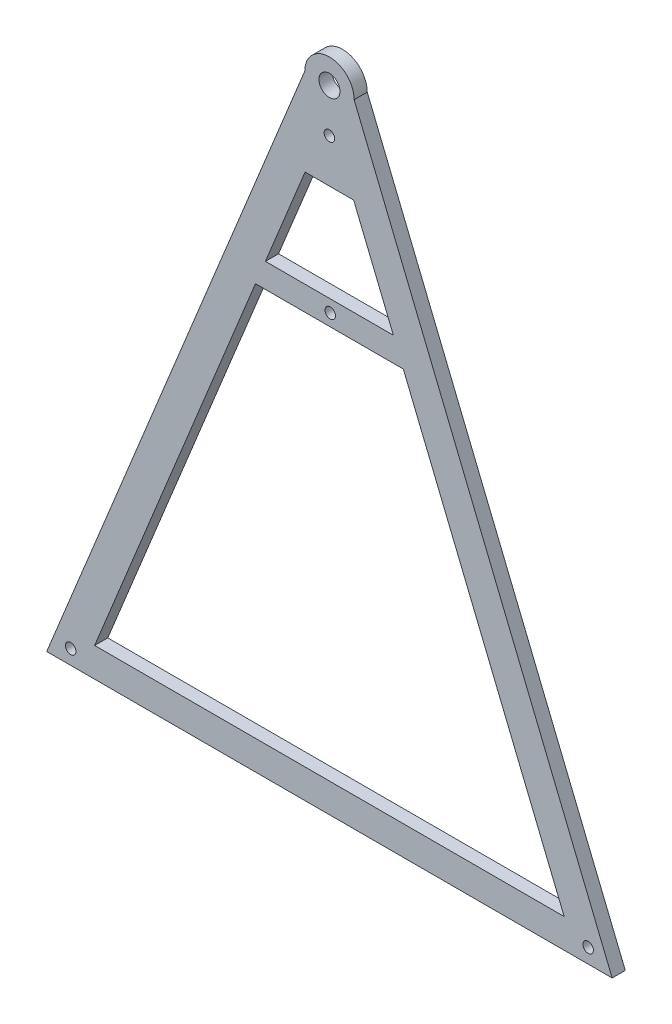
from build123d import *

# Parameters (mm, degrees)
SKETCH1_R           = 11.941930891
SKETCH1_R_2         = 5.08
BOSS_EXTRUDE2_DEPTH = 6.35
SKETCH2_R           = 2.54
CUT_EXTRUDE1_DEPTH  = 6.35
SKETCH3_R           = 2.54
CUT_EXTRUDE2_DEPTH  = 6.35
SKETCH4_R           = 2.54
CUT_EXTRUDE3_DEPTH  = 6.35
BOSS_EXTRUDE4_DEPTH = 6.35
SKETCH6_R           = 2.54
CUT_EXTRUDE4_DEPTH  = 6.35


with BuildPart() as part:
    # Sketch1 → Boss-Extrude2 (new body)
    # profile 1 of 2: a face of its own
    with BuildSketch(Plane.XY):
        with BuildLine():
            ThreePointArc((11.941930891, 0), (0, -11.941930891), (-11.941930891, 0))
            Line((-11.941930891, 0), (-136.770171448, -305.554470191))
            Line((-136.770171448, -305.554470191), (136.770171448, -305.554470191))
            Line((136.770171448, -305.554470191), (11.941930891, 0))
        make_face()
        Polygon((-11.770355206, -42.174693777), (11.728986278, -42.174693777), (113.552372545, -291.41789952), (-113.593741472, -291.41789952), align=None, mode=Mode.SUBTRACT)
    # profile 2 of 2: a face of its own
    with BuildSketch(Plane.XY):
        Circle(SKETCH1_R)
        Circle(SKETCH1_R_2, mode=Mode.SUBTRACT)
    extrude(amount=BOSS_EXTRUDE2_DEPTH)

    # Sketch2 → Cut-Extrude1 (cut)
    with BuildSketch(Plane.XY.offset(6.35)):
        with Locations((125.161271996, -298.486184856)):
            Circle(SKETCH2_R)
    extrude(amount=-CUT_EXTRUDE1_DEPTH, mode=Mode.SUBTRACT)

    # Sketch3 → Cut-Extrude2 (cut)
    with BuildSketch(Plane.XY.offset(6.35)):
        with Locations((-125.18195646, -298.486184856)):
            Circle(SKETCH3_R)
    extrude(amount=-CUT_EXTRUDE2_DEPTH, mode=Mode.SUBTRACT)

    # Sketch4 → Cut-Extrude3 (cut)
    with BuildSketch(Plane.XY.offset(6.35)):
        with Locations((-0.010342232, -21.087346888)):
            Circle(SKETCH4_R)
    extrude(amount=-CUT_EXTRUDE3_DEPTH, mode=Mode.SUBTRACT)

    # Sketch5 → Boss-Extrude4 (add)
    with BuildSketch(Plane.XY.offset(6.35)):
        Polygon((-30.978629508, -89.19269268), (30.93726058, -89.19269268), (35.740250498, -100.949447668), (-35.781619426, -100.949447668), align=None)
    extrude(amount=-BOSS_EXTRUDE4_DEPTH)

    # Sketch6 → Cut-Extrude4 (cut)
    with BuildSketch(Plane.XY.offset(6.35)):
        with Locations((0.408650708, -95.111508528)):
            Circle(SKETCH6_R)
    extrude(amount=-CUT_EXTRUDE4_DEPTH, mode=Mode.SUBTRACT)


solid = part.part
